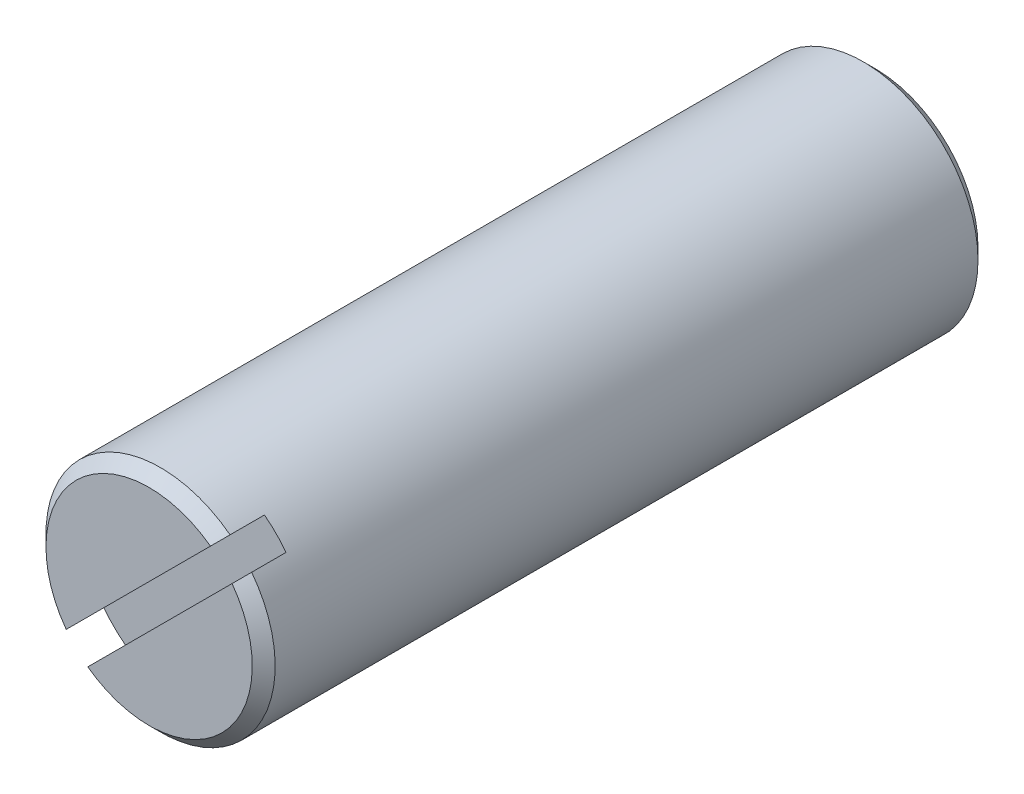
ISO-10303-21;
HEADER;
FILE_DESCRIPTION(('STEP AP214'),'2;1');
FILE_NAME('part.step','',(''),(''),'','','');
FILE_SCHEMA(('AUTOMOTIVE_DESIGN { 1 0 10303 214 1 1 1 1 }'));
ENDSEC;
DATA;
#1=APPLICATION_CONTEXT('core data for automotive mechanical design processes');
#2=APPLICATION_PROTOCOL_DEFINITION('international standard','automotive_design',2000,#1);
#3=PRODUCT_CONTEXT('',#1,'mechanical');
#4=PRODUCT('Part','Part','',(#3));
#5=PRODUCT_RELATED_PRODUCT_CATEGORY('part','',(#4));
#6=PRODUCT_DEFINITION_FORMATION('','',#4);
#7=PRODUCT_DEFINITION_CONTEXT('part definition',#1,'design');
#8=PRODUCT_DEFINITION('design','',#6,#7);
#9=PRODUCT_DEFINITION_SHAPE('','',#8);
#10=(LENGTH_UNIT() NAMED_UNIT(*) SI_UNIT(.MILLI.,.METRE.));
#11=(NAMED_UNIT(*) PLANE_ANGLE_UNIT() SI_UNIT($,.RADIAN.));
#12=(NAMED_UNIT(*) SI_UNIT($,.STERADIAN.) SOLID_ANGLE_UNIT());
#13=UNCERTAINTY_MEASURE_WITH_UNIT(LENGTH_MEASURE(1.E-05),#10,'distance_accuracy_value','');
#14=(GEOMETRIC_REPRESENTATION_CONTEXT(3) GLOBAL_UNCERTAINTY_ASSIGNED_CONTEXT((#13)) GLOBAL_UNIT_ASSIGNED_CONTEXT((#10,
#11,#12)) REPRESENTATION_CONTEXT('',''));
#15=CARTESIAN_POINT('',(0.,0.,0.));
#16=DIRECTION('',(0.,0.,1.));
#17=DIRECTION('',(1.,0.,0.));
#18=AXIS2_PLACEMENT_3D('',#15,#16,#17);
#19=CARTESIAN_POINT('',(0.,0.,95.));
#20=DIRECTION('',(0.,0.,1.));
#21=DIRECTION('',(1.,0.,0.));
#22=AXIS2_PLACEMENT_3D('',#19,#20,#21);
#23=PLANE('',#22);
#24=DIRECTION('',(0.707106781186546,0.707106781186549,0.));
#25=VECTOR('',#24,1.);
#26=CARTESIAN_POINT('',(-10.9601551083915,-13.7885822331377,95.));
#27=LINE('',#26,#25);
#28=CARTESIAN_POINT('',(-8.02639023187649,-10.8548173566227,95.));
#29=VERTEX_POINT('',#28);
#30=CARTESIAN_POINT('',(10.8548173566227,8.02639023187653,95.));
#31=VERTEX_POINT('',#30);
#32=EDGE_CURVE('E112',#29,#31,#27,.T.);
#33=ORIENTED_EDGE('',*,*,#32,.F.);
#34=CARTESIAN_POINT('',(0.,0.,95.));
#35=DIRECTION('',(0.,0.,1.));
#36=DIRECTION('',(1.,0.,0.));
#37=AXIS2_PLACEMENT_3D('',#34,#35,#36);
#38=CIRCLE('',#37,13.5);
#39=EDGE_CURVE('E116',#29,#31,#38,.T.);
#40=ORIENTED_EDGE('',*,*,#39,.T.);
#41=EDGE_LOOP('',(#33,#40));
#42=FACE_BOUND('',#41,.T.);
#43=ADVANCED_FACE('F34',(#42),#23,.T.);
#44=CARTESIAN_POINT('',(0.,0.,95.));
#45=DIRECTION('',(0.,0.,-1.));
#46=DIRECTION('',(-1.,0.,0.));
#47=AXIS2_PLACEMENT_3D('',#44,#45,#46);
#48=CONICAL_SURFACE('',#47,13.5,0.785398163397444);
#49=CARTESIAN_POINT('',(-24.016110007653,-26.8445371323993,72.4805231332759));
#50=CARTESIAN_POINT('',(-23.1500943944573,-25.9785215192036,73.7033504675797));
#51=CARTESIAN_POINT('',(-22.2840202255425,-25.1124473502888,74.9260948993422));
#52=CARTESIAN_POINT('',(-20.5516724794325,-23.3800996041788,77.3713264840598));
#53=CARTESIAN_POINT('',(-19.6853989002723,-22.5138260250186,78.5938136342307));
#54=CARTESIAN_POINT('',(-17.952386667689,-20.7808137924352,81.0386978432));
#55=CARTESIAN_POINT('',(-17.0856479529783,-19.9140750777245,82.2610948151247));
#56=CARTESIAN_POINT('',(-15.3517784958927,-18.180205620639,84.7053079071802));
#57=CARTESIAN_POINT('',(-14.4846477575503,-17.3130748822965,85.9271240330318));
#58=CARTESIAN_POINT('',(-12.7222832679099,-15.5507103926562,88.4085413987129));
#59=CARTESIAN_POINT('',(-11.8270292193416,-14.6554563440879,89.6681138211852));
#60=CARTESIAN_POINT('',(-10.483218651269,-13.3116457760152,91.5561893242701));
#61=CARTESIAN_POINT('',(-10.0351198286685,-12.8635469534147,92.1853438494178));
#62=CARTESIAN_POINT('',(-9.13848707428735,-11.9669141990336,93.443028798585));
#63=CARTESIAN_POINT('',(-8.68995314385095,-11.5183802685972,94.0715592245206));
#64=CARTESIAN_POINT('',(-7.79231211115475,-10.620739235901,95.3276132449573));
#65=CARTESIAN_POINT('',(-7.34320510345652,-10.1716322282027,95.9551369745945));
#66=CARTESIAN_POINT('',(-6.44400305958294,-9.27243018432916,97.2087838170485));
#67=CARTESIAN_POINT('',(-5.99390801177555,-8.82233513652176,97.8349069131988));
#68=CARTESIAN_POINT('',(-5.31752724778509,-8.1459543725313,98.772270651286));
#69=CARTESIAN_POINT('',(-5.09186674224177,-7.92029386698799,99.0844133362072));
#70=CARTESIAN_POINT('',(-4.63997691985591,-7.46840404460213,99.7078738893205));
#71=CARTESIAN_POINT('',(-4.41374760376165,-7.24217472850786,100.019191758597));
#72=CARTESIAN_POINT('',(-3.96050476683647,-6.78893189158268,100.640671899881));
#73=CARTESIAN_POINT('',(-3.73349126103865,-6.56191838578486,100.950834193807));
#74=CARTESIAN_POINT('',(-3.27833080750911,-6.10675793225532,101.569490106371));
#75=CARTESIAN_POINT('',(-3.05018386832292,-5.87861099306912,101.877983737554));
#76=CARTESIAN_POINT('',(-2.75947901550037,-5.58790614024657,102.267931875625));
#77=CARTESIAN_POINT('',(-2.6977265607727,-5.5261536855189,102.350587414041));
#78=CARTESIAN_POINT('',(-2.57407615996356,-5.40250328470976,102.515680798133));
#79=CARTESIAN_POINT('',(-2.51217821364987,-5.34060533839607,102.59811864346));
#80=CARTESIAN_POINT('',(-2.32623668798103,-5.15466381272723,102.845064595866));
#81=CARTESIAN_POINT('',(-2.20194708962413,-5.03037421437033,103.009202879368));
#82=CARTESIAN_POINT('',(-1.95289777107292,-4.78132489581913,103.33564929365));
#83=CARTESIAN_POINT('',(-1.82814076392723,-4.65656788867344,103.497961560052));
#84=CARTESIAN_POINT('',(-1.57747465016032,-4.40590177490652,103.82078992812));
#85=CARTESIAN_POINT('',(-1.45156558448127,-4.27999270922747,103.98130609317));
#86=CARTESIAN_POINT('',(-1.24001037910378,-4.06843750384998,104.247142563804));
#87=CARTESIAN_POINT('',(-1.15481030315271,-3.9832374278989,104.353172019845));
#88=CARTESIAN_POINT('',(-0.983483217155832,-3.81191034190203,104.563720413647));
#89=CARTESIAN_POINT('',(-0.897356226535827,-3.72578335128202,104.668239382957));
#90=CARTESIAN_POINT('',(-0.723380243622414,-3.55180736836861,104.875882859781));
#91=CARTESIAN_POINT('',(-0.63552404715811,-3.46395117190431,104.978995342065));
#92=CARTESIAN_POINT('',(-0.458217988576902,-3.2866451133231,105.182377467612));
#93=CARTESIAN_POINT('',(-0.368768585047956,-3.19719570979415,105.282647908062));
#94=CARTESIAN_POINT('',(-0.186614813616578,-3.01504193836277,105.480337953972));
#95=CARTESIAN_POINT('',(-0.0938846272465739,-2.92231175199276,105.577710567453));
#96=CARTESIAN_POINT('',(0.0476151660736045,-2.78081195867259,105.719176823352));
#97=CARTESIAN_POINT('',(0.0952189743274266,-2.73320815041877,105.76559975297));
#98=CARTESIAN_POINT('',(0.191355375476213,-2.63707174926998,105.856479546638));
#99=CARTESIAN_POINT('',(0.239887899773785,-2.58853922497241,105.900936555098));
#100=CARTESIAN_POINT('',(0.337636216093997,-2.4907909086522,105.987006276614));
#101=CARTESIAN_POINT('',(0.386842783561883,-2.44158434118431,106.028639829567));
#102=CARTESIAN_POINT('',(0.486529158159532,-2.34189796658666,106.108801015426));
#103=CARTESIAN_POINT('',(0.537009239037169,-2.29141788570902,106.147327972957));
#104=CARTESIAN_POINT('',(0.639275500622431,-2.18915162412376,106.220269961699));
#105=CARTESIAN_POINT('',(0.691057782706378,-2.13736934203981,106.254695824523));
#106=CARTESIAN_POINT('',(0.796179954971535,-2.03224716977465,106.31838900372));
#107=CARTESIAN_POINT('',(0.849519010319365,-1.97890811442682,106.347659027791));
#108=CARTESIAN_POINT('',(0.945231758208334,-1.88319536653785,106.393621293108));
#109=CARTESIAN_POINT('',(0.9872812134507,-1.84114591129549,106.411656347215));
#110=CARTESIAN_POINT('',(1.07223882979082,-1.75618829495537,106.443173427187));
#111=CARTESIAN_POINT('',(1.11514701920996,-1.71328010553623,106.456655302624));
#112=CARTESIAN_POINT('',(1.20148018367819,-1.626946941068,106.478387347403));
#113=CARTESIAN_POINT('',(1.24490291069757,-1.58352421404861,106.486655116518));
#114=CARTESIAN_POINT('',(1.33210263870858,-1.49632448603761,106.497572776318));
#115=CARTESIAN_POINT('',(1.37587961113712,-1.45254751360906,106.500223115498));
#116=CARTESIAN_POINT('',(1.46355985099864,-1.36486727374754,106.49974657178));
#117=CARTESIAN_POINT('',(1.50746306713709,-1.3209640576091,106.496600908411));
#118=CARTESIAN_POINT('',(1.59488246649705,-1.23354465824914,106.484685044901));
#119=CARTESIAN_POINT('',(1.63839862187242,-1.19002850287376,106.475914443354));
#120=CARTESIAN_POINT('',(1.7248811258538,-1.10354599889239,106.453196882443));
#121=CARTESIAN_POINT('',(1.76784533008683,-1.06058179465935,106.439233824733));
#122=CARTESIAN_POINT('',(1.85290070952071,-0.975526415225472,106.406787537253));
#123=CARTESIAN_POINT('',(1.89499182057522,-0.933435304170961,106.388303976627));
#124=CARTESIAN_POINT('',(2.02821766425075,-0.800209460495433,106.32302866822));
#125=CARTESIAN_POINT('',(2.11755360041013,-0.710873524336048,106.268895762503));
#126=CARTESIAN_POINT('',(2.29205479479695,-0.536372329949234,106.148499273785));
#127=CARTESIAN_POINT('',(2.37721133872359,-0.45121578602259,106.082211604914));
#128=CARTESIAN_POINT('',(2.54482395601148,-0.283603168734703,105.941204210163));
#129=CARTESIAN_POINT('',(2.62725362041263,-0.201173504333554,105.866422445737));
#130=CARTESIAN_POINT('',(2.7489057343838,-0.0795213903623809,105.750265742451));
#131=CARTESIAN_POINT('',(2.78910707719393,-0.0393200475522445,105.710901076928));
#132=CARTESIAN_POINT('',(2.86894587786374,0.0405187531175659,105.631045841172));
#133=CARTESIAN_POINT('',(2.90858335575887,0.0801562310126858,105.590555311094));
#134=CARTESIAN_POINT('',(3.03450414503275,0.206077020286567,105.459642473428));
#135=CARTESIAN_POINT('',(3.11985993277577,0.291432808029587,105.367437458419));
#136=CARTESIAN_POINT('',(3.28884476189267,0.460417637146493,105.179906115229));
#137=CARTESIAN_POINT('',(3.37247354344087,0.544046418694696,105.084579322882));
#138=CARTESIAN_POINT('',(3.53845552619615,0.710028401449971,104.891629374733));
#139=CARTESIAN_POINT('',(3.62080813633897,0.792381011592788,104.794005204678));
#140=CARTESIAN_POINT('',(3.78450146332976,0.956074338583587,104.597071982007));
#141=CARTESIAN_POINT('',(3.86584214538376,1.03741502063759,104.497762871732));
#142=CARTESIAN_POINT('',(4.10895667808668,1.28052955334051,104.197597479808));
#143=CARTESIAN_POINT('',(4.26954794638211,1.44112082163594,103.994827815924));
#144=CARTESIAN_POINT('',(4.58867072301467,1.76024359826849,103.586214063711));
#145=CARTESIAN_POINT('',(4.7472027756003,1.91877565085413,103.38037081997));
#146=CARTESIAN_POINT('',(5.06233781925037,2.2339106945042,102.967310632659));
#147=CARTESIAN_POINT('',(5.21894562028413,2.39051849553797,102.760101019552));
#148=CARTESIAN_POINT('',(5.53120219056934,2.70277506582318,102.34421416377));
#149=CARTESIAN_POINT('',(5.68685089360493,2.85842376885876,102.135536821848));
#150=CARTESIAN_POINT('',(5.99727928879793,3.16885216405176,101.717335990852));
#151=CARTESIAN_POINT('',(6.15205969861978,3.32363257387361,101.507813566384));
#152=CARTESIAN_POINT('',(6.46107825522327,3.6326511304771,101.087981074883));
#153=CARTESIAN_POINT('',(6.61531641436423,3.78688928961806,100.877671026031));
#154=CARTESIAN_POINT('',(7.07622047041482,4.24779334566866,100.247469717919));
#155=CARTESIAN_POINT('',(7.38227547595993,4.55384835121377,99.8266851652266));
#156=CARTESIAN_POINT('',(7.99335809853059,5.16493097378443,98.9836260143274));
#157=CARTESIAN_POINT('',(8.29838571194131,5.46995858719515,98.561351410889));
#158=CARTESIAN_POINT('',(8.90774814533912,6.07932102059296,97.7157891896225));
#159=CARTESIAN_POINT('',(9.2120829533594,6.38365582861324,97.2925015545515));
#160=CARTESIAN_POINT('',(9.82025899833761,6.99183187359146,96.4452175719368));
#161=CARTESIAN_POINT('',(10.12410023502,7.29567311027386,96.0212212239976));
#162=CARTESIAN_POINT('',(11.0353308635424,8.2069037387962,94.7481332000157));
#163=CARTESIAN_POINT('',(11.6421863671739,8.81375924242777,93.8982773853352));
#164=CARTESIAN_POINT('',(12.8550747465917,10.0266476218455,92.1974068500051));
#165=CARTESIAN_POINT('',(13.4611076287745,10.6326805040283,91.3463921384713));
#166=CARTESIAN_POINT('',(14.6728062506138,11.8443791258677,89.6433965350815));
#167=CARTESIAN_POINT('',(15.2784718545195,12.4500447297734,88.7914154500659));
#168=CARTESIAN_POINT('',(16.4894511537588,13.6610240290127,87.0869498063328));
#169=CARTESIAN_POINT('',(17.0947648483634,14.2663377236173,86.2344652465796));
#170=CARTESIAN_POINT('',(18.9102126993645,16.0817855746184,83.6766696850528));
#171=CARTESIAN_POINT('',(20.1199803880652,17.2915532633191,81.970838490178));
#172=CARTESIAN_POINT('',(21.7892384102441,18.960811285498,79.6160720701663));
#173=CARTESIAN_POINT('',(22.2489549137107,19.4205277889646,78.9674573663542));
#174=CARTESIAN_POINT('',(23.1683324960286,20.3399053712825,77.6701202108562));
#175=CARTESIAN_POINT('',(23.6279935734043,20.7995664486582,77.0213977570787));
#176=CARTESIAN_POINT('',(24.5471660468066,21.7187389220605,75.7240125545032));
#177=CARTESIAN_POINT('',(25.0066774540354,22.1782503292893,75.0753498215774));
#178=CARTESIAN_POINT('',(25.9256445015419,23.0972173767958,73.7779745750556));
#179=CARTESIAN_POINT('',(26.3851001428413,23.5566730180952,73.1292620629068));
#180=CARTESIAN_POINT('',(26.8445371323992,24.0161100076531,72.4805231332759));
#181=B_SPLINE_CURVE_WITH_KNOTS('',3,(#49,#50,#51,#52,#53,#54,#55,#56,#57,#58,#59,#60,#61,#62,
#63,#64,#65,#66,#67,#68,#69,#70,#71,#72,#73,#74,#75,#76,#77,#78,#79,#80,#81,#82,#83,#84,#85,#86,
#87,#88,#89,#90,#91,#92,#93,#94,#95,#96,#97,#98,#99,#100,#101,#102,#103,#104,#105,#106,#107,
#108,#109,#110,#111,#112,#113,#114,#115,#116,#117,#118,#119,#120,#121,#122,#123,#124,#125,#126,
#127,#128,#129,#130,#131,#132,#133,#134,#135,#136,#137,#138,#139,#140,#141,#142,#143,#144,#145,
#146,#147,#148,#149,#150,#151,#152,#153,#154,#155,#156,#157,#158,#159,#160,#161,#162,#163,#164,
#165,#166,#167,#168,#169,#170,#171,#172,#173,#174,#175,#176,#177,#178,#179,#180),.UNSPECIFIED.,
.F.,.F.,(4,2,2,2,2,2,2,2,2,2,2,2,2,2,2,2,2,2,2,2,2,2,2,2,2,2,2,2,2,2,2,2,2,2,2,2,2,2,2,2,2,2,2,
2,2,2,2,2,2,2,2,2,2,2,2,2,2,2,2,2,2,2,2,2,2,4),(0.,5.19205694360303,10.3841674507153,
15.5774838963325,20.7707480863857,26.128483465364,28.807435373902,31.4863790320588,
34.164926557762,36.8435057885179,38.1827230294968,39.5219385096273,40.8611284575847,
42.2003083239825,42.5610406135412,42.9217734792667,43.6432489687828,44.3624524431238,
45.0816304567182,45.5631221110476,46.0446036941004,46.5289551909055,47.013169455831,
47.5030407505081,47.7483431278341,47.9936274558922,48.2368414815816,48.480108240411,
48.7227175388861,48.9651990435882,49.1514727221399,49.337752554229,49.5234002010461,
49.7090330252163,49.8952684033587,50.0815170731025,50.2683480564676,50.4551927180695,
50.8663944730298,51.2784200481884,51.6936762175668,51.9011213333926,52.1085590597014,
52.564169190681,53.0198473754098,53.4757306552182,53.9316295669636,54.8449470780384,
55.7580180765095,56.6678930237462,57.5778301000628,58.4868502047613,59.3958494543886,
61.2068066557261,63.0177702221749,64.8287648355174,66.6397604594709,70.2631844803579,
73.8865801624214,77.5109143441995,81.1352560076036,88.3831807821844,91.1382517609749,
93.8933845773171,96.6479413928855,99.4024362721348),.UNSPECIFIED.);
#182=CARTESIAN_POINT('',(-9.0976844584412,-11.9261115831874,93.5));
#183=VERTEX_POINT('',#182);
#184=EDGE_CURVE('E223',#183,#29,#181,.T.);
#185=ORIENTED_EDGE('',*,*,#184,.F.);
#186=CARTESIAN_POINT('',(0.,0.,93.5));
#187=DIRECTION('',(0.,0.,1.));
#188=DIRECTION('',(1.,0.,0.));
#189=AXIS2_PLACEMENT_3D('',#186,#187,#188);
#190=CIRCLE('',#189,15.);
#191=CARTESIAN_POINT('',(11.9261115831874,9.09768445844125,93.5));
#192=VERTEX_POINT('',#191);
#193=EDGE_CURVE('E119',#192,#183,#190,.F.);
#194=ORIENTED_EDGE('',*,*,#193,.F.);
#195=EDGE_CURVE('E105',#31,#192,#181,.T.);
#196=ORIENTED_EDGE('',*,*,#195,.F.);
#197=ORIENTED_EDGE('',*,*,#39,.F.);
#198=EDGE_LOOP('',(#185,#194,#196,#197));
#199=FACE_BOUND('',#198,.T.);
#200=ADVANCED_FACE('F179',(#199),#48,.T.);
#201=CARTESIAN_POINT('',(0.,0.,95.));
#202=DIRECTION('',(0.,0.,-1.));
#203=DIRECTION('',(-1.,0.,0.));
#204=AXIS2_PLACEMENT_3D('',#201,#202,#203);
#205=CYLINDRICAL_SURFACE('',#204,15.);
#206=CARTESIAN_POINT('',(0.,0.,89.));
#207=DIRECTION('',(0.,0.,1.));
#208=DIRECTION('',(1.,0.,0.));
#209=AXIS2_PLACEMENT_3D('',#206,#207,#208);
#210=CIRCLE('',#209,15.);
#211=CARTESIAN_POINT('',(11.9261115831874,9.09768445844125,89.));
#212=VERTEX_POINT('',#211);
#213=CARTESIAN_POINT('',(9.0976844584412,11.9261115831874,89.));
#214=VERTEX_POINT('',#213);
#215=EDGE_CURVE('E11',#212,#214,#210,.T.);
#216=ORIENTED_EDGE('',*,*,#215,.F.);
#217=DIRECTION('',(0.,0.,-1.));
#218=VECTOR('',#217,1.);
#219=CARTESIAN_POINT('',(11.9261115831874,9.09768445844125,95.));
#220=LINE('',#219,#218);
#221=EDGE_CURVE('E208',#212,#192,#220,.F.);
#222=ORIENTED_EDGE('',*,*,#221,.T.);
#223=ORIENTED_EDGE('',*,*,#193,.T.);
#224=DIRECTION('',(0.,0.,-1.));
#225=VECTOR('',#224,1.);
#226=CARTESIAN_POINT('',(-9.0976844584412,-11.9261115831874,95.));
#227=LINE('',#226,#225);
#228=CARTESIAN_POINT('',(-9.0976844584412,-11.9261115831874,89.));
#229=VERTEX_POINT('',#228);
#230=EDGE_CURVE('E204',#183,#229,#227,.T.);
#231=ORIENTED_EDGE('',*,*,#230,.T.);
#232=CARTESIAN_POINT('',(-11.9261115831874,-9.09768445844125,89.));
#233=VERTEX_POINT('',#232);
#234=EDGE_CURVE('E38',#233,#229,#210,.T.);
#235=ORIENTED_EDGE('',*,*,#234,.F.);
#236=DIRECTION('',(0.,0.,-1.));
#237=VECTOR('',#236,1.);
#238=CARTESIAN_POINT('',(-11.9261115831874,-9.09768445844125,95.));
#239=LINE('',#238,#237);
#240=CARTESIAN_POINT('',(-11.9261115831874,-9.09768445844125,93.5));
#241=VERTEX_POINT('',#240);
#242=EDGE_CURVE('E211',#233,#241,#239,.F.);
#243=ORIENTED_EDGE('',*,*,#242,.T.);
#244=CARTESIAN_POINT('',(9.0976844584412,11.9261115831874,93.5));
#245=VERTEX_POINT('',#244);
#246=EDGE_CURVE('E128',#241,#245,#190,.F.);
#247=ORIENTED_EDGE('',*,*,#246,.T.);
#248=DIRECTION('',(0.,0.,-1.));
#249=VECTOR('',#248,1.);
#250=CARTESIAN_POINT('',(9.0976844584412,11.9261115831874,95.));
#251=LINE('',#250,#249);
#252=EDGE_CURVE('E100',#245,#214,#251,.T.);
#253=ORIENTED_EDGE('',*,*,#252,.T.);
#254=EDGE_LOOP('',(#216,#222,#223,#231,#235,#243,#247,#253));
#255=FACE_BOUND('',#254,.T.);
#256=CARTESIAN_POINT('',(0.,0.,75.));
#257=DIRECTION('',(0.,0.,1.));
#258=DIRECTION('',(1.,0.,0.));
#259=AXIS2_PLACEMENT_3D('',#256,#257,#258);
#260=CIRCLE('',#259,15.);
#261=CARTESIAN_POINT('',(-7.48331477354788,-13.,75.));
#262=VERTEX_POINT('',#261);
#263=CARTESIAN_POINT('',(7.48331477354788,-13.,75.));
#264=VERTEX_POINT('',#263);
#265=EDGE_CURVE('E135',#262,#264,#260,.T.);
#266=ORIENTED_EDGE('',*,*,#265,.T.);
#267=DIRECTION('',(0.,0.,-1.));
#268=VECTOR('',#267,1.);
#269=CARTESIAN_POINT('',(7.48331477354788,-13.,95.));
#270=LINE('',#269,#268);
#271=CARTESIAN_POINT('',(7.48331477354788,-13.,20.));
#272=VERTEX_POINT('',#271);
#273=EDGE_CURVE('E141',#264,#272,#270,.T.);
#274=ORIENTED_EDGE('',*,*,#273,.T.);
#275=CARTESIAN_POINT('',(0.,0.,20.));
#276=DIRECTION('',(0.,0.,-1.));
#277=DIRECTION('',(-1.,0.,0.));
#278=AXIS2_PLACEMENT_3D('',#275,#276,#277);
#279=CIRCLE('',#278,15.);
#280=CARTESIAN_POINT('',(-7.48331477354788,-13.,20.));
#281=VERTEX_POINT('',#280);
#282=EDGE_CURVE('E138',#272,#281,#279,.T.);
#283=ORIENTED_EDGE('',*,*,#282,.T.);
#284=DIRECTION('',(0.,0.,-1.));
#285=VECTOR('',#284,1.);
#286=CARTESIAN_POINT('',(-7.48331477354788,-13.,95.));
#287=LINE('',#286,#285);
#288=EDGE_CURVE('E132',#281,#262,#287,.F.);
#289=ORIENTED_EDGE('',*,*,#288,.T.);
#290=EDGE_LOOP('',(#266,#274,#283,#289));
#291=FACE_BOUND('',#290,.T.);
#292=CARTESIAN_POINT('',(0.,0.,1.5));
#293=DIRECTION('',(0.,0.,1.));
#294=DIRECTION('',(1.,0.,0.));
#295=AXIS2_PLACEMENT_3D('',#292,#293,#294);
#296=CIRCLE('',#295,15.);
#297=CARTESIAN_POINT('',(15.,0.,1.5));
#298=VERTEX_POINT('',#297);
#299=EDGE_CURVE('E115',#298,#298,#296,.T.);
#300=ORIENTED_EDGE('',*,*,#299,.T.);
#301=EDGE_LOOP('',(#300));
#302=FACE_BOUND('',#301,.T.);
#303=ADVANCED_FACE('F36',(#255,#291,#302),#205,.T.);
#304=DIRECTION('',(-0.707106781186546,-0.707106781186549,0.));
#305=VECTOR('',#304,1.);
#306=CARTESIAN_POINT('',(10.9601551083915,13.7885822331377,95.));
#307=LINE('',#306,#305);
#308=CARTESIAN_POINT('',(8.02639023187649,10.8548173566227,95.));
#309=VERTEX_POINT('',#308);
#310=CARTESIAN_POINT('',(-10.8548173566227,-8.02639023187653,95.));
#311=VERTEX_POINT('',#310);
#312=EDGE_CURVE('E49',#309,#311,#307,.T.);
#313=ORIENTED_EDGE('',*,*,#312,.F.);
#314=EDGE_CURVE('E111',#309,#311,#38,.T.);
#315=ORIENTED_EDGE('',*,*,#314,.T.);
#316=EDGE_LOOP('',(#313,#315));
#317=FACE_BOUND('',#316,.T.);
#318=ADVANCED_FACE('F110',(#317),#23,.T.);
#319=CARTESIAN_POINT('',(0.,0.,0.));
#320=DIRECTION('',(0.,0.,1.));
#321=DIRECTION('',(1.,0.,0.));
#322=AXIS2_PLACEMENT_3D('',#319,#320,#321);
#323=PLANE('',#322);
#324=CARTESIAN_POINT('',(0.,0.,0.));
#325=DIRECTION('',(0.,0.,1.));
#326=DIRECTION('',(1.,0.,0.));
#327=AXIS2_PLACEMENT_3D('',#324,#325,#326);
#328=CIRCLE('',#327,13.5);
#329=CARTESIAN_POINT('',(13.5,0.,0.));
#330=VERTEX_POINT('',#329);
#331=EDGE_CURVE('E129',#330,#330,#328,.F.);
#332=ORIENTED_EDGE('',*,*,#331,.T.);
#333=EDGE_LOOP('',(#332));
#334=FACE_BOUND('',#333,.T.);
#335=ADVANCED_FACE('F178',(#334),#323,.F.);
#336=CARTESIAN_POINT('',(24.016110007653,26.8445371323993,72.4805231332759));
#337=CARTESIAN_POINT('',(23.1500943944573,25.9785215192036,73.7033504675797));
#338=CARTESIAN_POINT('',(22.2840202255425,25.1124473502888,74.9260948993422));
#339=CARTESIAN_POINT('',(20.5516724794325,23.3800996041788,77.3713264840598));
#340=CARTESIAN_POINT('',(19.6853989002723,22.5138260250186,78.5938136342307));
#341=CARTESIAN_POINT('',(17.952386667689,20.7808137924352,81.0386978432));
#342=CARTESIAN_POINT('',(17.0856479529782,19.9140750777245,82.2610948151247));
#343=CARTESIAN_POINT('',(15.3517784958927,18.180205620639,84.7053079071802));
#344=CARTESIAN_POINT('',(14.4846477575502,17.3130748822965,85.9271240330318));
#345=CARTESIAN_POINT('',(12.7222832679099,15.5507103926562,88.4085413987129));
#346=CARTESIAN_POINT('',(11.8270292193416,14.6554563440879,89.6681138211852));
#347=CARTESIAN_POINT('',(10.483218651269,13.3116457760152,91.5561893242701));
#348=CARTESIAN_POINT('',(10.0351198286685,12.8635469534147,92.1853438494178));
#349=CARTESIAN_POINT('',(9.13848707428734,11.9669141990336,93.443028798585));
#350=CARTESIAN_POINT('',(8.68995314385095,11.5183802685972,94.0715592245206));
#351=CARTESIAN_POINT('',(7.79231211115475,10.620739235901,95.3276132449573));
#352=CARTESIAN_POINT('',(7.34320510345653,10.1716322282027,95.9551369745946));
#353=CARTESIAN_POINT('',(6.44400305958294,9.27243018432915,97.2087838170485));
#354=CARTESIAN_POINT('',(5.99390801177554,8.82233513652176,97.8349069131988));
#355=CARTESIAN_POINT('',(5.31752724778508,8.14595437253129,98.772270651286));
#356=CARTESIAN_POINT('',(5.09186674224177,7.92029386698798,99.0844133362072));
#357=CARTESIAN_POINT('',(4.63997691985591,7.46840404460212,99.7078738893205));
#358=CARTESIAN_POINT('',(4.41374760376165,7.24217472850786,100.019191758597));
#359=CARTESIAN_POINT('',(3.96050476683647,6.78893189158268,100.640671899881));
#360=CARTESIAN_POINT('',(3.73349126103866,6.56191838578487,100.950834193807));
#361=CARTESIAN_POINT('',(3.27833080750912,6.10675793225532,101.569490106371));
#362=CARTESIAN_POINT('',(3.05018386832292,5.87861099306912,101.877983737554));
#363=CARTESIAN_POINT('',(2.75947901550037,5.58790614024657,102.267931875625));
#364=CARTESIAN_POINT('',(2.6977265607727,5.5261536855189,102.350587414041));
#365=CARTESIAN_POINT('',(2.57407615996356,5.40250328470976,102.515680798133));
#366=CARTESIAN_POINT('',(2.51217821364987,5.34060533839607,102.59811864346));
#367=CARTESIAN_POINT('',(2.32623668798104,5.15466381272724,102.845064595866));
#368=CARTESIAN_POINT('',(2.20194708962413,5.03037421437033,103.009202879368));
#369=CARTESIAN_POINT('',(1.95289777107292,4.78132489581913,103.33564929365));
#370=CARTESIAN_POINT('',(1.82814076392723,4.65656788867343,103.497961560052));
#371=CARTESIAN_POINT('',(1.57747465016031,4.40590177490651,103.82078992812));
#372=CARTESIAN_POINT('',(1.45156558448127,4.27999270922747,103.98130609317));
#373=CARTESIAN_POINT('',(1.24001037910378,4.06843750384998,104.247142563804));
#374=CARTESIAN_POINT('',(1.1548103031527,3.98323742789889,104.353172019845));
#375=CARTESIAN_POINT('',(0.983483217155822,3.81191034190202,104.563720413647));
#376=CARTESIAN_POINT('',(0.89735622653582,3.72578335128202,104.668239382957));
#377=CARTESIAN_POINT('',(0.723380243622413,3.55180736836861,104.875882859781));
#378=CARTESIAN_POINT('',(0.63552404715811,3.4639511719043,104.978995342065));
#379=CARTESIAN_POINT('',(0.458217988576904,3.2866451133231,105.182377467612));
#380=CARTESIAN_POINT('',(0.368768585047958,3.19719570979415,105.282647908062));
#381=CARTESIAN_POINT('',(0.186614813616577,3.01504193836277,105.480337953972));
#382=CARTESIAN_POINT('',(0.0938846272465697,2.92231175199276,105.577710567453));
#383=CARTESIAN_POINT('',(-0.047615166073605,2.78081195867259,105.719176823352));
#384=CARTESIAN_POINT('',(-0.0952189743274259,2.73320815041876,105.76559975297));
#385=CARTESIAN_POINT('',(-0.191355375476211,2.63707174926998,105.856479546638));
#386=CARTESIAN_POINT('',(-0.239887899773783,2.58853922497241,105.900936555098));
#387=CARTESIAN_POINT('',(-0.337636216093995,2.49079090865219,105.987006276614));
#388=CARTESIAN_POINT('',(-0.386842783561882,2.44158434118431,106.028639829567));
#389=CARTESIAN_POINT('',(-0.486529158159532,2.34189796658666,106.108801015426));
#390=CARTESIAN_POINT('',(-0.53700923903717,2.29141788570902,106.147327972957));
#391=CARTESIAN_POINT('',(-0.63927550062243,2.18915162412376,106.220269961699));
#392=CARTESIAN_POINT('',(-0.691057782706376,2.13736934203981,106.254695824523));
#393=CARTESIAN_POINT('',(-0.796179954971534,2.03224716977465,106.31838900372));
#394=CARTESIAN_POINT('',(-0.849519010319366,1.97890811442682,106.347659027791));
#395=CARTESIAN_POINT('',(-0.945231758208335,1.88319536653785,106.393621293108));
#396=CARTESIAN_POINT('',(-0.9872812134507,1.84114591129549,106.411656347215));
#397=CARTESIAN_POINT('',(-1.07223882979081,1.75618829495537,106.443173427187));
#398=CARTESIAN_POINT('',(-1.11514701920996,1.71328010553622,106.456655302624));
#399=CARTESIAN_POINT('',(-1.20148018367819,1.62694694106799,106.478387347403));
#400=CARTESIAN_POINT('',(-1.24490291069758,1.58352421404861,106.486655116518));
#401=CARTESIAN_POINT('',(-1.33210263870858,1.49632448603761,106.497572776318));
#402=CARTESIAN_POINT('',(-1.37587961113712,1.45254751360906,106.500223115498));
#403=CARTESIAN_POINT('',(-1.46355985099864,1.36486727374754,106.49974657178));
#404=CARTESIAN_POINT('',(-1.50746306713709,1.3209640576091,106.496600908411));
#405=CARTESIAN_POINT('',(-1.59488246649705,1.23354465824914,106.484685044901));
#406=CARTESIAN_POINT('',(-1.63839862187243,1.19002850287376,106.475914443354));
#407=CARTESIAN_POINT('',(-1.7248811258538,1.10354599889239,106.453196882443));
#408=CARTESIAN_POINT('',(-1.76784533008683,1.06058179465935,106.439233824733));
#409=CARTESIAN_POINT('',(-1.85290070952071,0.975526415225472,106.406787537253));
#410=CARTESIAN_POINT('',(-1.89499182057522,0.933435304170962,106.388303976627));
#411=CARTESIAN_POINT('',(-2.02821766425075,0.800209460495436,106.32302866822));
#412=CARTESIAN_POINT('',(-2.11755360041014,0.71087352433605,106.268895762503));
#413=CARTESIAN_POINT('',(-2.29205479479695,0.536372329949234,106.148499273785));
#414=CARTESIAN_POINT('',(-2.37721133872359,0.45121578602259,106.082211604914));
#415=CARTESIAN_POINT('',(-2.54482395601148,0.283603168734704,105.941204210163));
#416=CARTESIAN_POINT('',(-2.62725362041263,0.201173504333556,105.866422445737));
#417=CARTESIAN_POINT('',(-2.7489057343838,0.0795213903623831,105.750265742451));
#418=CARTESIAN_POINT('',(-2.78910707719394,0.0393200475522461,105.710901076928));
#419=CARTESIAN_POINT('',(-2.86894587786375,-0.0405187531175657,105.631045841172));
#420=CARTESIAN_POINT('',(-2.90858335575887,-0.0801562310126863,105.590555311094));
#421=CARTESIAN_POINT('',(-3.03450414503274,-0.206077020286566,105.459642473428));
#422=CARTESIAN_POINT('',(-3.11985993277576,-0.291432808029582,105.367437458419));
#423=CARTESIAN_POINT('',(-3.28884476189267,-0.460417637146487,105.179906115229));
#424=CARTESIAN_POINT('',(-3.37247354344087,-0.544046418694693,105.084579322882));
#425=CARTESIAN_POINT('',(-3.53845552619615,-0.710028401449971,104.891629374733));
#426=CARTESIAN_POINT('',(-3.62080813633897,-0.792381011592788,104.794005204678));
#427=CARTESIAN_POINT('',(-3.78450146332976,-0.956074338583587,104.597071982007));
#428=CARTESIAN_POINT('',(-3.86584214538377,-1.03741502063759,104.497762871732));
#429=CARTESIAN_POINT('',(-4.10895667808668,-1.2805295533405,104.197597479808));
#430=CARTESIAN_POINT('',(-4.26954794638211,-1.44112082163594,103.994827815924));
#431=CARTESIAN_POINT('',(-4.58867072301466,-1.76024359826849,103.586214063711));
#432=CARTESIAN_POINT('',(-4.7472027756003,-1.91877565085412,103.38037081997));
#433=CARTESIAN_POINT('',(-5.06233781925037,-2.2339106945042,102.967310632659));
#434=CARTESIAN_POINT('',(-5.21894562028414,-2.39051849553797,102.760101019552));
#435=CARTESIAN_POINT('',(-5.53120219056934,-2.70277506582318,102.34421416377));
#436=CARTESIAN_POINT('',(-5.68685089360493,-2.85842376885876,102.135536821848));
#437=CARTESIAN_POINT('',(-5.99727928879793,-3.16885216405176,101.717335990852));
#438=CARTESIAN_POINT('',(-6.15205969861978,-3.32363257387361,101.507813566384));
#439=CARTESIAN_POINT('',(-6.46107825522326,-3.63265113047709,101.087981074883));
#440=CARTESIAN_POINT('',(-6.61531641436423,-3.78688928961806,100.877671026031));
#441=CARTESIAN_POINT('',(-7.07622047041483,-4.24779334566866,100.247469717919));
#442=CARTESIAN_POINT('',(-7.38227547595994,-4.55384835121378,99.8266851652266));
#443=CARTESIAN_POINT('',(-7.9933580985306,-5.16493097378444,98.9836260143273));
#444=CARTESIAN_POINT('',(-8.29838571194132,-5.46995858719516,98.561351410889));
#445=CARTESIAN_POINT('',(-8.90774814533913,-6.07932102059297,97.7157891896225));
#446=CARTESIAN_POINT('',(-9.21208295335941,-6.38365582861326,97.2925015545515));
#447=CARTESIAN_POINT('',(-9.82025899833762,-6.99183187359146,96.4452175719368));
#448=CARTESIAN_POINT('',(-10.12410023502,-7.29567311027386,96.0212212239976));
#449=CARTESIAN_POINT('',(-11.0353308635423,-8.2069037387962,94.7481332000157));
#450=CARTESIAN_POINT('',(-11.6421863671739,-8.81375924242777,93.8982773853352));
#451=CARTESIAN_POINT('',(-12.8550747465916,-10.0266476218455,92.1974068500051));
#452=CARTESIAN_POINT('',(-13.4611076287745,-10.6326805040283,91.3463921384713));
#453=CARTESIAN_POINT('',(-14.6728062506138,-11.8443791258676,89.6433965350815));
#454=CARTESIAN_POINT('',(-15.2784718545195,-12.4500447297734,88.7914154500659));
#455=CARTESIAN_POINT('',(-16.4894511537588,-13.6610240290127,87.0869498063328));
#456=CARTESIAN_POINT('',(-17.0947648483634,-14.2663377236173,86.2344652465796));
#457=CARTESIAN_POINT('',(-18.9102126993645,-16.0817855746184,83.6766696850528));
#458=CARTESIAN_POINT('',(-20.1199803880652,-17.2915532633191,81.9708384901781));
#459=CARTESIAN_POINT('',(-21.7892384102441,-18.960811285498,79.6160720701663));
#460=CARTESIAN_POINT('',(-22.2489549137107,-19.4205277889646,78.9674573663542));
#461=CARTESIAN_POINT('',(-23.1683324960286,-20.3399053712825,77.6701202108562));
#462=CARTESIAN_POINT('',(-23.6279935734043,-20.7995664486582,77.0213977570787));
#463=CARTESIAN_POINT('',(-24.5471660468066,-21.7187389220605,75.7240125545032));
#464=CARTESIAN_POINT('',(-25.0066774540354,-22.1782503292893,75.0753498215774));
#465=CARTESIAN_POINT('',(-25.9256445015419,-23.0972173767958,73.7779745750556));
#466=CARTESIAN_POINT('',(-26.3851001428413,-23.5566730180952,73.1292620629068));
#467=CARTESIAN_POINT('',(-26.8445371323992,-24.0161100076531,72.4805231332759));
#468=B_SPLINE_CURVE_WITH_KNOTS('',3,(#336,#337,#338,#339,#340,#341,#342,#343,#344,#345,#346,
#347,#348,#349,#350,#351,#352,#353,#354,#355,#356,#357,#358,#359,#360,#361,#362,#363,#364,#365,
#366,#367,#368,#369,#370,#371,#372,#373,#374,#375,#376,#377,#378,#379,#380,#381,#382,#383,#384,
#385,#386,#387,#388,#389,#390,#391,#392,#393,#394,#395,#396,#397,#398,#399,#400,#401,#402,#403,
#404,#405,#406,#407,#408,#409,#410,#411,#412,#413,#414,#415,#416,#417,#418,#419,#420,#421,#422,
#423,#424,#425,#426,#427,#428,#429,#430,#431,#432,#433,#434,#435,#436,#437,#438,#439,#440,#441,
#442,#443,#444,#445,#446,#447,#448,#449,#450,#451,#452,#453,#454,#455,#456,#457,#458,#459,#460,
#461,#462,#463,#464,#465,#466,#467),.UNSPECIFIED.,.F.,.F.,(4,2,2,2,2,2,2,2,2,2,2,2,2,2,2,2,2,2,
2,2,2,2,2,2,2,2,2,2,2,2,2,2,2,2,2,2,2,2,2,2,2,2,2,2,2,2,2,2,2,2,2,2,2,2,2,2,2,2,2,2,2,2,2,2,2,
4),(0.,5.19205694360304,10.3841674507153,15.5774838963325,20.7707480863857,26.128483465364,
28.807435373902,31.4863790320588,34.164926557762,36.8435057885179,38.1827230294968,
39.5219385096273,40.8611284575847,42.2003083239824,42.5610406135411,42.9217734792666,
43.6432489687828,44.3624524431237,45.0816304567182,45.5631221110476,46.0446036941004,
46.5289551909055,47.013169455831,47.5030407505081,47.7483431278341,47.9936274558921,
48.2368414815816,48.4801082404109,48.7227175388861,48.9651990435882,49.1514727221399,
49.3377525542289,49.5234002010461,49.7090330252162,49.8952684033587,50.0815170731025,
50.2683480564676,50.4551927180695,50.8663944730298,51.2784200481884,51.6936762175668,
51.9011213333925,52.1085590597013,52.5641691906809,53.0198473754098,53.4757306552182,
53.9316295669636,54.8449470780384,55.7580180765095,56.6678930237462,57.5778301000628,
58.4868502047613,59.3958494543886,61.2068066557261,63.0177702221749,64.8287648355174,
66.6397604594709,70.2631844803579,73.8865801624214,77.5109143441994,81.1352560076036,
88.3831807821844,91.1382517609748,93.8933845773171,96.6479413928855,99.4024362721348),.UNSPECIFIED.);
#469=EDGE_CURVE('E96',#245,#309,#468,.T.);
#470=ORIENTED_EDGE('',*,*,#469,.F.);
#471=ORIENTED_EDGE('',*,*,#246,.F.);
#472=EDGE_CURVE('E106',#311,#241,#468,.T.);
#473=ORIENTED_EDGE('',*,*,#472,.F.);
#474=ORIENTED_EDGE('',*,*,#314,.F.);
#475=EDGE_LOOP('',(#470,#471,#473,#474));
#476=FACE_BOUND('',#475,.T.);
#477=ADVANCED_FACE('F114',(#476),#48,.T.);
#478=CARTESIAN_POINT('',(0.,0.,1.5));
#479=DIRECTION('',(0.,0.,1.));
#480=DIRECTION('',(1.,0.,0.));
#481=AXIS2_PLACEMENT_3D('',#478,#479,#480);
#482=CONICAL_SURFACE('',#481,15.,0.78539816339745);
#483=ORIENTED_EDGE('',*,*,#331,.F.);
#484=EDGE_LOOP('',(#483));
#485=FACE_BOUND('',#484,.T.);
#486=ORIENTED_EDGE('',*,*,#299,.F.);
#487=EDGE_LOOP('',(#486));
#488=FACE_BOUND('',#487,.T.);
#489=ADVANCED_FACE('F171',(#485,#488),#482,.T.);
#490=CARTESIAN_POINT('',(-15.,-13.,20.));
#491=DIRECTION('',(0.,0.,-1.));
#492=DIRECTION('',(-1.,0.,0.));
#493=AXIS2_PLACEMENT_3D('',#490,#491,#492);
#494=PLANE('',#493);
#495=DIRECTION('',(1.,0.,0.));
#496=VECTOR('',#495,1.);
#497=CARTESIAN_POINT('',(-15.,-13.,20.));
#498=LINE('',#497,#496);
#499=EDGE_CURVE('E123',#281,#272,#498,.T.);
#500=ORIENTED_EDGE('',*,*,#499,.F.);
#501=ORIENTED_EDGE('',*,*,#282,.F.);
#502=EDGE_LOOP('',(#500,#501));
#503=FACE_BOUND('',#502,.T.);
#504=ADVANCED_FACE('F165',(#503),#494,.F.);
#505=CARTESIAN_POINT('',(-15.,-13.,75.));
#506=DIRECTION('',(0.,0.,1.));
#507=DIRECTION('',(1.,0.,0.));
#508=AXIS2_PLACEMENT_3D('',#505,#506,#507);
#509=PLANE('',#508);
#510=DIRECTION('',(1.,0.,0.));
#511=VECTOR('',#510,1.);
#512=CARTESIAN_POINT('',(-15.,-13.,75.));
#513=LINE('',#512,#511);
#514=EDGE_CURVE('E57',#262,#264,#513,.T.);
#515=ORIENTED_EDGE('',*,*,#514,.T.);
#516=ORIENTED_EDGE('',*,*,#265,.F.);
#517=EDGE_LOOP('',(#515,#516));
#518=FACE_BOUND('',#517,.T.);
#519=ADVANCED_FACE('F161',(#518),#509,.F.);
#520=CARTESIAN_POINT('',(-15.,-13.,20.));
#521=DIRECTION('',(0.,1.,0.));
#522=DIRECTION('',(0.,0.,1.));
#523=AXIS2_PLACEMENT_3D('',#520,#521,#522);
#524=PLANE('',#523);
#525=ORIENTED_EDGE('',*,*,#514,.F.);
#526=ORIENTED_EDGE('',*,*,#288,.F.);
#527=ORIENTED_EDGE('',*,*,#499,.T.);
#528=ORIENTED_EDGE('',*,*,#273,.F.);
#529=EDGE_LOOP('',(#525,#526,#527,#528));
#530=FACE_BOUND('',#529,.T.);
#531=ADVANCED_FACE('F164',(#530),#524,.F.);
#532=CARTESIAN_POINT('',(10.9601551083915,13.7885822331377,89.));
#533=DIRECTION('',(0.,0.,1.));
#534=DIRECTION('',(1.,0.,0.));
#535=AXIS2_PLACEMENT_3D('',#532,#533,#534);
#536=PLANE('',#535);
#537=ORIENTED_EDGE('',*,*,#215,.T.);
#538=DIRECTION('',(-0.707106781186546,-0.707106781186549,0.));
#539=VECTOR('',#538,1.);
#540=CARTESIAN_POINT('',(10.9601551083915,13.7885822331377,89.));
#541=LINE('',#540,#539);
#542=EDGE_CURVE('E217',#214,#233,#541,.T.);
#543=ORIENTED_EDGE('',*,*,#542,.T.);
#544=ORIENTED_EDGE('',*,*,#234,.T.);
#545=DIRECTION('',(0.707106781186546,0.707106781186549,0.));
#546=VECTOR('',#545,1.);
#547=CARTESIAN_POINT('',(-10.9601551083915,-13.7885822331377,89.));
#548=LINE('',#547,#546);
#549=EDGE_CURVE('E214',#229,#212,#548,.T.);
#550=ORIENTED_EDGE('',*,*,#549,.T.);
#551=EDGE_LOOP('',(#537,#543,#544,#550));
#552=FACE_BOUND('',#551,.T.);
#553=ADVANCED_FACE('F169',(#552),#536,.T.);
#554=CARTESIAN_POINT('',(-10.9601551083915,-13.7885822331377,89.));
#555=DIRECTION('',(0.707106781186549,-0.707106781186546,0.));
#556=DIRECTION('',(0.707106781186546,0.707106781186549,0.));
#557=AXIS2_PLACEMENT_3D('',#554,#555,#556);
#558=PLANE('',#557);
#559=ORIENTED_EDGE('',*,*,#184,.T.);
#560=ORIENTED_EDGE('',*,*,#32,.T.);
#561=ORIENTED_EDGE('',*,*,#195,.T.);
#562=ORIENTED_EDGE('',*,*,#221,.F.);
#563=ORIENTED_EDGE('',*,*,#549,.F.);
#564=ORIENTED_EDGE('',*,*,#230,.F.);
#565=EDGE_LOOP('',(#559,#560,#561,#562,#563,#564));
#566=FACE_BOUND('',#565,.T.);
#567=ADVANCED_FACE('F158',(#566),#558,.F.);
#568=CARTESIAN_POINT('',(10.9601551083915,13.7885822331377,89.));
#569=DIRECTION('',(-0.707106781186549,0.707106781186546,0.));
#570=DIRECTION('',(-0.707106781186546,-0.707106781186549,0.));
#571=AXIS2_PLACEMENT_3D('',#568,#569,#570);
#572=PLANE('',#571);
#573=ORIENTED_EDGE('',*,*,#469,.T.);
#574=ORIENTED_EDGE('',*,*,#312,.T.);
#575=ORIENTED_EDGE('',*,*,#472,.T.);
#576=ORIENTED_EDGE('',*,*,#242,.F.);
#577=ORIENTED_EDGE('',*,*,#542,.F.);
#578=ORIENTED_EDGE('',*,*,#252,.F.);
#579=EDGE_LOOP('',(#573,#574,#575,#576,#577,#578));
#580=FACE_BOUND('',#579,.T.);
#581=ADVANCED_FACE('F97',(#580),#572,.F.);
#582=CLOSED_SHELL('',(#43,#200,#303,#318,#335,#477,#489,#504,#519,#531,#553,#567,#581));
#583=MANIFOLD_SOLID_BREP('B2',#582);
#584=ADVANCED_BREP_SHAPE_REPRESENTATION('',(#18,#583),#14);
#585=SHAPE_DEFINITION_REPRESENTATION(#9,#584);
ENDSEC;
END-ISO-10303-21;
